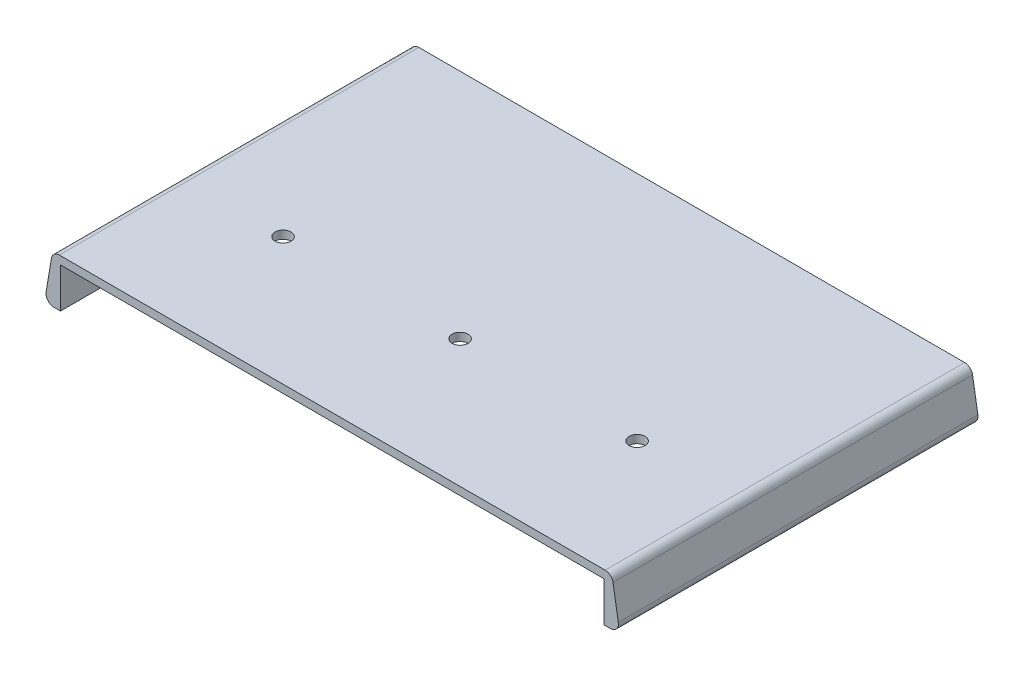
ISO-10303-21;
HEADER;
FILE_DESCRIPTION(('STEP AP214'),'2;1');
FILE_NAME('part.step','',(''),(''),'','','');
FILE_SCHEMA(('AUTOMOTIVE_DESIGN { 1 0 10303 214 1 1 1 1 }'));
ENDSEC;
DATA;
#1=APPLICATION_CONTEXT('core data for automotive mechanical design processes');
#2=APPLICATION_PROTOCOL_DEFINITION('international standard','automotive_design',2000,#1);
#3=PRODUCT_CONTEXT('',#1,'mechanical');
#4=PRODUCT('Part','Part','',(#3));
#5=PRODUCT_RELATED_PRODUCT_CATEGORY('part','',(#4));
#6=PRODUCT_DEFINITION_FORMATION('','',#4);
#7=PRODUCT_DEFINITION_CONTEXT('part definition',#1,'design');
#8=PRODUCT_DEFINITION('design','',#6,#7);
#9=PRODUCT_DEFINITION_SHAPE('','',#8);
#10=(LENGTH_UNIT() NAMED_UNIT(*) SI_UNIT(.MILLI.,.METRE.));
#11=(NAMED_UNIT(*) PLANE_ANGLE_UNIT() SI_UNIT($,.RADIAN.));
#12=(NAMED_UNIT(*) SI_UNIT($,.STERADIAN.) SOLID_ANGLE_UNIT());
#13=UNCERTAINTY_MEASURE_WITH_UNIT(LENGTH_MEASURE(1.E-05),#10,'distance_accuracy_value','');
#14=(GEOMETRIC_REPRESENTATION_CONTEXT(3) GLOBAL_UNCERTAINTY_ASSIGNED_CONTEXT((#13)) GLOBAL_UNIT_ASSIGNED_CONTEXT((#10,
#11,#12)) REPRESENTATION_CONTEXT('',''));
#15=CARTESIAN_POINT('',(0.,0.,0.));
#16=DIRECTION('',(0.,0.,1.));
#17=DIRECTION('',(1.,0.,0.));
#18=AXIS2_PLACEMENT_3D('',#15,#16,#17);
#19=CARTESIAN_POINT('',(-215.9,0.,285.75));
#20=DIRECTION('',(-1.,0.,0.));
#21=DIRECTION('',(0.,0.,1.));
#22=AXIS2_PLACEMENT_3D('',#19,#20,#21);
#23=PLANE('',#22);
#24=DIRECTION('',(0.,1.,0.));
#25=VECTOR('',#24,1.);
#26=CARTESIAN_POINT('',(-215.9,0.,0.));
#27=LINE('',#26,#25);
#28=CARTESIAN_POINT('',(-215.9,-31.75,0.));
#29=VERTEX_POINT('',#28);
#30=CARTESIAN_POINT('',(-215.9,0.,0.));
#31=VERTEX_POINT('',#30);
#32=EDGE_CURVE('E159',#29,#31,#27,.T.);
#33=ORIENTED_EDGE('',*,*,#32,.T.);
#34=DIRECTION('',(0.,0.,-1.));
#35=VECTOR('',#34,1.);
#36=CARTESIAN_POINT('',(-215.9,0.,285.75));
#37=LINE('',#36,#35);
#38=CARTESIAN_POINT('',(-215.9,0.,285.75));
#39=VERTEX_POINT('',#38);
#40=EDGE_CURVE('E12',#39,#31,#37,.T.);
#41=ORIENTED_EDGE('',*,*,#40,.F.);
#42=DIRECTION('',(0.,1.,0.));
#43=VECTOR('',#42,1.);
#44=CARTESIAN_POINT('',(-215.9,0.,285.75));
#45=LINE('',#44,#43);
#46=CARTESIAN_POINT('',(-215.9,-31.75,285.75));
#47=VERTEX_POINT('',#46);
#48=EDGE_CURVE('E182',#47,#39,#45,.T.);
#49=ORIENTED_EDGE('',*,*,#48,.F.);
#50=DIRECTION('',(0.,0.,-1.));
#51=VECTOR('',#50,1.);
#52=CARTESIAN_POINT('',(-215.9,-31.75,285.75));
#53=LINE('',#52,#51);
#54=EDGE_CURVE('E155',#47,#29,#53,.T.);
#55=ORIENTED_EDGE('',*,*,#54,.T.);
#56=EDGE_LOOP('',(#33,#41,#49,#55));
#57=FACE_BOUND('',#56,.T.);
#58=ADVANCED_FACE('F39',(#57),#23,.F.);
#59=CARTESIAN_POINT('',(-215.9,0.,285.75));
#60=DIRECTION('',(0.,1.,0.));
#61=DIRECTION('',(0.,0.,1.));
#62=AXIS2_PLACEMENT_3D('',#59,#60,#61);
#63=PLANE('',#62);
#64=CARTESIAN_POINT('',(140.670742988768,0.,184.15));
#65=DIRECTION('',(0.,1.,0.));
#66=DIRECTION('',(0.,0.,1.));
#67=AXIS2_PLACEMENT_3D('',#64,#65,#66);
#68=CIRCLE('',#67,6.34999999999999);
#69=CARTESIAN_POINT('',(140.670742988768,0.,190.5));
#70=VERTEX_POINT('',#69);
#71=EDGE_CURVE('E371',#70,#70,#68,.T.);
#72=ORIENTED_EDGE('',*,*,#71,.T.);
#73=EDGE_LOOP('',(#72));
#74=FACE_BOUND('',#73,.T.);
#75=CARTESIAN_POINT('',(0.,0.,184.15));
#76=DIRECTION('',(0.,1.,0.));
#77=DIRECTION('',(0.,0.,1.));
#78=AXIS2_PLACEMENT_3D('',#75,#76,#77);
#79=CIRCLE('',#78,6.34999999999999);
#80=CARTESIAN_POINT('',(0.,0.,190.5));
#81=VERTEX_POINT('',#80);
#82=EDGE_CURVE('E375',#81,#81,#79,.T.);
#83=ORIENTED_EDGE('',*,*,#82,.T.);
#84=EDGE_LOOP('',(#83));
#85=FACE_BOUND('',#84,.T.);
#86=CARTESIAN_POINT('',(-140.670742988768,0.,184.15));
#87=DIRECTION('',(0.,1.,0.));
#88=DIRECTION('',(0.,0.,1.));
#89=AXIS2_PLACEMENT_3D('',#86,#87,#88);
#90=CIRCLE('',#89,6.34999999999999);
#91=CARTESIAN_POINT('',(-140.670742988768,0.,190.5));
#92=VERTEX_POINT('',#91);
#93=EDGE_CURVE('E163',#92,#92,#90,.T.);
#94=ORIENTED_EDGE('',*,*,#93,.T.);
#95=EDGE_LOOP('',(#94));
#96=FACE_BOUND('',#95,.T.);
#97=DIRECTION('',(1.,0.,0.));
#98=VECTOR('',#97,1.);
#99=CARTESIAN_POINT('',(-215.9,0.,0.));
#100=LINE('',#99,#98);
#101=CARTESIAN_POINT('',(215.9,0.,0.));
#102=VERTEX_POINT('',#101);
#103=EDGE_CURVE('E162',#31,#102,#100,.T.);
#104=ORIENTED_EDGE('',*,*,#103,.T.);
#105=DIRECTION('',(0.,0.,-1.));
#106=VECTOR('',#105,1.);
#107=CARTESIAN_POINT('',(215.9,0.,285.75));
#108=LINE('',#107,#106);
#109=CARTESIAN_POINT('',(215.9,0.,285.75));
#110=VERTEX_POINT('',#109);
#111=EDGE_CURVE('E47',#110,#102,#108,.T.);
#112=ORIENTED_EDGE('',*,*,#111,.F.);
#113=DIRECTION('',(1.,0.,0.));
#114=VECTOR('',#113,1.);
#115=CARTESIAN_POINT('',(-215.9,0.,285.75));
#116=LINE('',#115,#114);
#117=EDGE_CURVE('E110',#39,#110,#116,.T.);
#118=ORIENTED_EDGE('',*,*,#117,.F.);
#119=ORIENTED_EDGE('',*,*,#40,.T.);
#120=EDGE_LOOP('',(#104,#112,#118,#119));
#121=FACE_BOUND('',#120,.T.);
#122=ADVANCED_FACE('F260',(#74,#85,#96,#121),#63,.F.);
#123=CARTESIAN_POINT('',(215.9,0.,285.75));
#124=DIRECTION('',(1.,0.,0.));
#125=DIRECTION('',(0.,0.,-1.));
#126=AXIS2_PLACEMENT_3D('',#123,#124,#125);
#127=PLANE('',#126);
#128=DIRECTION('',(0.,-1.,0.));
#129=VECTOR('',#128,1.);
#130=CARTESIAN_POINT('',(215.9,0.,0.));
#131=LINE('',#130,#129);
#132=CARTESIAN_POINT('',(215.9,-31.75,0.));
#133=VERTEX_POINT('',#132);
#134=EDGE_CURVE('E165',#102,#133,#131,.T.);
#135=ORIENTED_EDGE('',*,*,#134,.T.);
#136=DIRECTION('',(0.,0.,-1.));
#137=VECTOR('',#136,1.);
#138=CARTESIAN_POINT('',(215.9,-31.75,285.75));
#139=LINE('',#138,#137);
#140=CARTESIAN_POINT('',(215.9,-31.75,285.75));
#141=VERTEX_POINT('',#140);
#142=EDGE_CURVE('E201',#141,#133,#139,.T.);
#143=ORIENTED_EDGE('',*,*,#142,.F.);
#144=DIRECTION('',(0.,-1.,0.));
#145=VECTOR('',#144,1.);
#146=CARTESIAN_POINT('',(215.9,0.,285.75));
#147=LINE('',#146,#145);
#148=EDGE_CURVE('E209',#110,#141,#147,.T.);
#149=ORIENTED_EDGE('',*,*,#148,.F.);
#150=ORIENTED_EDGE('',*,*,#111,.T.);
#151=EDGE_LOOP('',(#135,#143,#149,#150));
#152=FACE_BOUND('',#151,.T.);
#153=ADVANCED_FACE('F207',(#152),#127,.F.);
#154=CARTESIAN_POINT('',(215.9,-31.75,285.75));
#155=DIRECTION('',(0.,1.,0.));
#156=DIRECTION('',(-1.,0.,0.));
#157=AXIS2_PLACEMENT_3D('',#154,#155,#156);
#158=PLANE('',#157);
#159=DIRECTION('',(1.,0.,0.));
#160=VECTOR('',#159,1.);
#161=CARTESIAN_POINT('',(215.9,-31.75,0.));
#162=LINE('',#161,#160);
#163=CARTESIAN_POINT('',(221.104076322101,-31.75,0.));
#164=VERTEX_POINT('',#163);
#165=EDGE_CURVE('E167',#133,#164,#162,.T.);
#166=ORIENTED_EDGE('',*,*,#165,.T.);
#167=DIRECTION('',(0.,0.,-1.));
#168=VECTOR('',#167,1.);
#169=CARTESIAN_POINT('',(221.104076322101,-31.75,285.75));
#170=LINE('',#169,#168);
#171=CARTESIAN_POINT('',(221.104076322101,-31.75,285.75));
#172=VERTEX_POINT('',#171);
#173=EDGE_CURVE('E198',#172,#164,#170,.T.);
#174=ORIENTED_EDGE('',*,*,#173,.F.);
#175=DIRECTION('',(1.,0.,0.));
#176=VECTOR('',#175,1.);
#177=CARTESIAN_POINT('',(215.9,-31.75,285.75));
#178=LINE('',#177,#176);
#179=EDGE_CURVE('E227',#141,#172,#178,.T.);
#180=ORIENTED_EDGE('',*,*,#179,.F.);
#181=ORIENTED_EDGE('',*,*,#142,.T.);
#182=EDGE_LOOP('',(#166,#174,#180,#181));
#183=FACE_BOUND('',#182,.T.);
#184=ADVANCED_FACE('F218',(#183),#158,.F.);
#185=CARTESIAN_POINT('',(221.104076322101,-25.4,285.75));
#186=DIRECTION('',(0.,0.,-1.));
#187=DIRECTION('',(-1.,0.,0.));
#188=AXIS2_PLACEMENT_3D('',#185,#186,#187);
#189=CYLINDRICAL_SURFACE('',#188,6.34999999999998);
#190=CARTESIAN_POINT('',(221.104076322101,-25.4,0.));
#191=DIRECTION('',(0.,0.,1.));
#192=DIRECTION('',(1.,0.,0.));
#193=AXIS2_PLACEMENT_3D('',#190,#191,#192);
#194=CIRCLE('',#193,6.34999999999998);
#195=CARTESIAN_POINT('',(227.367677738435,-24.356066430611,0.));
#196=VERTEX_POINT('',#195);
#197=EDGE_CURVE('E169',#164,#196,#194,.T.);
#198=ORIENTED_EDGE('',*,*,#197,.T.);
#199=DIRECTION('',(0.,0.,-1.));
#200=VECTOR('',#199,1.);
#201=CARTESIAN_POINT('',(227.367677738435,-24.356066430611,285.75));
#202=LINE('',#201,#200);
#203=CARTESIAN_POINT('',(227.367677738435,-24.356066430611,285.75));
#204=VERTEX_POINT('',#203);
#205=EDGE_CURVE('E195',#204,#196,#202,.T.);
#206=ORIENTED_EDGE('',*,*,#205,.F.);
#207=CARTESIAN_POINT('',(221.104076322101,-25.4,285.75));
#208=DIRECTION('',(0.,0.,1.));
#209=DIRECTION('',(1.,0.,0.));
#210=AXIS2_PLACEMENT_3D('',#207,#208,#209);
#211=CIRCLE('',#210,6.34999999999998);
#212=EDGE_CURVE('E224',#172,#204,#211,.T.);
#213=ORIENTED_EDGE('',*,*,#212,.F.);
#214=ORIENTED_EDGE('',*,*,#173,.T.);
#215=EDGE_LOOP('',(#198,#206,#213,#214));
#216=FACE_BOUND('',#215,.T.);
#217=ADVANCED_FACE('F222',(#216),#189,.T.);
#218=CARTESIAN_POINT('',(227.367677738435,-24.356066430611,285.75));
#219=DIRECTION('',(-0.986393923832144,-0.164398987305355,0.));
#220=DIRECTION('',(0.164398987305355,-0.986393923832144,0.));
#221=AXIS2_PLACEMENT_3D('',#218,#219,#220);
#222=PLANE('',#221);
#223=DIRECTION('',(-0.164398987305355,0.986393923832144,0.));
#224=VECTOR('',#223,1.);
#225=CARTESIAN_POINT('',(227.367677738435,-24.356066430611,0.));
#226=LINE('',#225,#224);
#227=CARTESIAN_POINT('',(223.134344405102,1.04393356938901,0.));
#228=VERTEX_POINT('',#227);
#229=EDGE_CURVE('E171',#196,#228,#226,.T.);
#230=ORIENTED_EDGE('',*,*,#229,.T.);
#231=DIRECTION('',(0.,0.,-1.));
#232=VECTOR('',#231,1.);
#233=CARTESIAN_POINT('',(223.134344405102,1.04393356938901,285.75));
#234=LINE('',#233,#232);
#235=CARTESIAN_POINT('',(223.134344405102,1.04393356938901,285.75));
#236=VERTEX_POINT('',#235);
#237=EDGE_CURVE('E192',#236,#228,#234,.T.);
#238=ORIENTED_EDGE('',*,*,#237,.F.);
#239=DIRECTION('',(-0.164398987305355,0.986393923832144,0.));
#240=VECTOR('',#239,1.);
#241=CARTESIAN_POINT('',(227.367677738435,-24.356066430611,285.75));
#242=LINE('',#241,#240);
#243=EDGE_CURVE('E226',#204,#236,#242,.T.);
#244=ORIENTED_EDGE('',*,*,#243,.F.);
#245=ORIENTED_EDGE('',*,*,#205,.T.);
#246=EDGE_LOOP('',(#230,#238,#244,#245));
#247=FACE_BOUND('',#246,.T.);
#248=ADVANCED_FACE('F276',(#247),#222,.F.);
#249=CARTESIAN_POINT('',(216.870742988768,0.,285.75));
#250=DIRECTION('',(0.,0.,-1.));
#251=DIRECTION('',(-1.,0.,0.));
#252=AXIS2_PLACEMENT_3D('',#249,#250,#251);
#253=CYLINDRICAL_SURFACE('',#252,6.34999999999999);
#254=CARTESIAN_POINT('',(216.870742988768,0.,0.));
#255=DIRECTION('',(0.,0.,1.));
#256=DIRECTION('',(1.,0.,0.));
#257=AXIS2_PLACEMENT_3D('',#254,#255,#256);
#258=CIRCLE('',#257,6.34999999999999);
#259=CARTESIAN_POINT('',(216.870742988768,6.34999999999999,0.));
#260=VERTEX_POINT('',#259);
#261=EDGE_CURVE('E173',#228,#260,#258,.T.);
#262=ORIENTED_EDGE('',*,*,#261,.T.);
#263=DIRECTION('',(0.,0.,-1.));
#264=VECTOR('',#263,1.);
#265=CARTESIAN_POINT('',(216.870742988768,6.34999999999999,285.75));
#266=LINE('',#265,#264);
#267=CARTESIAN_POINT('',(216.870742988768,6.34999999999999,285.75));
#268=VERTEX_POINT('',#267);
#269=EDGE_CURVE('E189',#268,#260,#266,.T.);
#270=ORIENTED_EDGE('',*,*,#269,.F.);
#271=CARTESIAN_POINT('',(216.870742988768,0.,285.75));
#272=DIRECTION('',(0.,0.,1.));
#273=DIRECTION('',(1.,0.,0.));
#274=AXIS2_PLACEMENT_3D('',#271,#272,#273);
#275=CIRCLE('',#274,6.34999999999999);
#276=EDGE_CURVE('E229',#236,#268,#275,.T.);
#277=ORIENTED_EDGE('',*,*,#276,.F.);
#278=ORIENTED_EDGE('',*,*,#237,.T.);
#279=EDGE_LOOP('',(#262,#270,#277,#278));
#280=FACE_BOUND('',#279,.T.);
#281=ADVANCED_FACE('F279',(#280),#253,.T.);
#282=CARTESIAN_POINT('',(216.870742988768,6.34999999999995,285.75));
#283=DIRECTION('',(0.,-1.,0.));
#284=DIRECTION('',(0.,0.,-1.));
#285=AXIS2_PLACEMENT_3D('',#282,#283,#284);
#286=PLANE('',#285);
#287=CARTESIAN_POINT('',(140.670742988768,6.34999999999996,184.15));
#288=DIRECTION('',(0.,1.,0.));
#289=DIRECTION('',(0.,0.,1.));
#290=AXIS2_PLACEMENT_3D('',#287,#288,#289);
#291=CIRCLE('',#290,6.34999999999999);
#292=CARTESIAN_POINT('',(140.670742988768,6.34999999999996,190.5));
#293=VERTEX_POINT('',#292);
#294=EDGE_CURVE('E369',#293,#293,#291,.T.);
#295=ORIENTED_EDGE('',*,*,#294,.F.);
#296=EDGE_LOOP('',(#295));
#297=FACE_BOUND('',#296,.T.);
#298=CARTESIAN_POINT('',(0.,6.34999999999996,184.15));
#299=DIRECTION('',(0.,1.,0.));
#300=DIRECTION('',(0.,0.,1.));
#301=AXIS2_PLACEMENT_3D('',#298,#299,#300);
#302=CIRCLE('',#301,6.34999999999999);
#303=CARTESIAN_POINT('',(0.,6.34999999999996,190.5));
#304=VERTEX_POINT('',#303);
#305=EDGE_CURVE('E372',#304,#304,#302,.T.);
#306=ORIENTED_EDGE('',*,*,#305,.F.);
#307=EDGE_LOOP('',(#306));
#308=FACE_BOUND('',#307,.T.);
#309=CARTESIAN_POINT('',(-140.670742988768,6.34999999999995,184.15));
#310=DIRECTION('',(0.,1.,0.));
#311=DIRECTION('',(0.,0.,1.));
#312=AXIS2_PLACEMENT_3D('',#309,#310,#311);
#313=CIRCLE('',#312,6.34999999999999);
#314=CARTESIAN_POINT('',(-140.670742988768,6.34999999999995,190.5));
#315=VERTEX_POINT('',#314);
#316=EDGE_CURVE('E381',#315,#315,#313,.T.);
#317=ORIENTED_EDGE('',*,*,#316,.F.);
#318=EDGE_LOOP('',(#317));
#319=FACE_BOUND('',#318,.T.);
#320=DIRECTION('',(-1.,0.,0.));
#321=VECTOR('',#320,1.);
#322=CARTESIAN_POINT('',(216.870742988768,6.34999999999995,0.));
#323=LINE('',#322,#321);
#324=CARTESIAN_POINT('',(-216.870742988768,6.34999999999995,0.));
#325=VERTEX_POINT('',#324);
#326=EDGE_CURVE('E175',#260,#325,#323,.T.);
#327=ORIENTED_EDGE('',*,*,#326,.T.);
#328=DIRECTION('',(0.,0.,-1.));
#329=VECTOR('',#328,1.);
#330=CARTESIAN_POINT('',(-216.870742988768,6.34999999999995,285.75));
#331=LINE('',#330,#329);
#332=CARTESIAN_POINT('',(-216.870742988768,6.34999999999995,285.75));
#333=VERTEX_POINT('',#332);
#334=EDGE_CURVE('E186',#333,#325,#331,.T.);
#335=ORIENTED_EDGE('',*,*,#334,.F.);
#336=DIRECTION('',(-1.,0.,0.));
#337=VECTOR('',#336,1.);
#338=CARTESIAN_POINT('',(216.870742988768,6.34999999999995,285.75));
#339=LINE('',#338,#337);
#340=EDGE_CURVE('E235',#268,#333,#339,.T.);
#341=ORIENTED_EDGE('',*,*,#340,.F.);
#342=ORIENTED_EDGE('',*,*,#269,.T.);
#343=EDGE_LOOP('',(#327,#335,#341,#342));
#344=FACE_BOUND('',#343,.T.);
#345=ADVANCED_FACE('F241',(#297,#308,#319,#344),#286,.F.);
#346=CARTESIAN_POINT('',(-216.870742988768,0.,285.75));
#347=DIRECTION('',(0.,0.,-1.));
#348=DIRECTION('',(-1.,0.,0.));
#349=AXIS2_PLACEMENT_3D('',#346,#347,#348);
#350=CYLINDRICAL_SURFACE('',#349,6.34999999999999);
#351=CARTESIAN_POINT('',(-216.870742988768,0.,0.));
#352=DIRECTION('',(0.,0.,1.));
#353=DIRECTION('',(-1.,0.,0.));
#354=AXIS2_PLACEMENT_3D('',#351,#352,#353);
#355=CIRCLE('',#354,6.34999999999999);
#356=CARTESIAN_POINT('',(-223.134344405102,1.043933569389,0.));
#357=VERTEX_POINT('',#356);
#358=EDGE_CURVE('E177',#325,#357,#355,.T.);
#359=ORIENTED_EDGE('',*,*,#358,.T.);
#360=DIRECTION('',(0.,0.,-1.));
#361=VECTOR('',#360,1.);
#362=CARTESIAN_POINT('',(-223.134344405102,1.043933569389,285.75));
#363=LINE('',#362,#361);
#364=CARTESIAN_POINT('',(-223.134344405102,1.043933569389,285.75));
#365=VERTEX_POINT('',#364);
#366=EDGE_CURVE('E150',#365,#357,#363,.T.);
#367=ORIENTED_EDGE('',*,*,#366,.F.);
#368=CARTESIAN_POINT('',(-216.870742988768,0.,285.75));
#369=DIRECTION('',(0.,0.,1.));
#370=DIRECTION('',(-1.,0.,0.));
#371=AXIS2_PLACEMENT_3D('',#368,#369,#370);
#372=CIRCLE('',#371,6.34999999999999);
#373=EDGE_CURVE('E141',#333,#365,#372,.T.);
#374=ORIENTED_EDGE('',*,*,#373,.F.);
#375=ORIENTED_EDGE('',*,*,#334,.T.);
#376=EDGE_LOOP('',(#359,#367,#374,#375));
#377=FACE_BOUND('',#376,.T.);
#378=ADVANCED_FACE('F245',(#377),#350,.T.);
#379=CARTESIAN_POINT('',(-227.367677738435,-24.356066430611,285.75));
#380=DIRECTION('',(0.986393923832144,-0.164398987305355,0.));
#381=DIRECTION('',(0.164398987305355,0.986393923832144,0.));
#382=AXIS2_PLACEMENT_3D('',#379,#380,#381);
#383=PLANE('',#382);
#384=DIRECTION('',(-0.164398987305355,-0.986393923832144,0.));
#385=VECTOR('',#384,1.);
#386=CARTESIAN_POINT('',(-227.367677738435,-24.356066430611,0.));
#387=LINE('',#386,#385);
#388=CARTESIAN_POINT('',(-227.367677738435,-24.356066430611,0.));
#389=VERTEX_POINT('',#388);
#390=EDGE_CURVE('E149',#357,#389,#387,.T.);
#391=ORIENTED_EDGE('',*,*,#390,.T.);
#392=DIRECTION('',(0.,0.,-1.));
#393=VECTOR('',#392,1.);
#394=CARTESIAN_POINT('',(-227.367677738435,-24.356066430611,285.75));
#395=LINE('',#394,#393);
#396=CARTESIAN_POINT('',(-227.367677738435,-24.356066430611,285.75));
#397=VERTEX_POINT('',#396);
#398=EDGE_CURVE('E146',#397,#389,#395,.T.);
#399=ORIENTED_EDGE('',*,*,#398,.F.);
#400=DIRECTION('',(-0.164398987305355,-0.986393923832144,0.));
#401=VECTOR('',#400,1.);
#402=CARTESIAN_POINT('',(-227.367677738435,-24.356066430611,285.75));
#403=LINE('',#402,#401);
#404=EDGE_CURVE('E135',#365,#397,#403,.T.);
#405=ORIENTED_EDGE('',*,*,#404,.F.);
#406=ORIENTED_EDGE('',*,*,#366,.T.);
#407=EDGE_LOOP('',(#391,#399,#405,#406));
#408=FACE_BOUND('',#407,.T.);
#409=ADVANCED_FACE('F147',(#408),#383,.F.);
#410=CARTESIAN_POINT('',(-221.104076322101,-25.4,285.75));
#411=DIRECTION('',(0.,0.,-1.));
#412=DIRECTION('',(-1.,0.,0.));
#413=AXIS2_PLACEMENT_3D('',#410,#411,#412);
#414=CYLINDRICAL_SURFACE('',#413,6.34999999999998);
#415=CARTESIAN_POINT('',(-221.104076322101,-25.4,0.));
#416=DIRECTION('',(0.,0.,1.));
#417=DIRECTION('',(-1.,0.,0.));
#418=AXIS2_PLACEMENT_3D('',#415,#416,#417);
#419=CIRCLE('',#418,6.34999999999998);
#420=CARTESIAN_POINT('',(-221.104076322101,-31.75,0.));
#421=VERTEX_POINT('',#420);
#422=EDGE_CURVE('E96',#389,#421,#419,.T.);
#423=ORIENTED_EDGE('',*,*,#422,.T.);
#424=DIRECTION('',(0.,0.,-1.));
#425=VECTOR('',#424,1.);
#426=CARTESIAN_POINT('',(-221.104076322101,-31.75,285.75));
#427=LINE('',#426,#425);
#428=CARTESIAN_POINT('',(-221.104076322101,-31.75,285.75));
#429=VERTEX_POINT('',#428);
#430=EDGE_CURVE('E151',#429,#421,#427,.T.);
#431=ORIENTED_EDGE('',*,*,#430,.F.);
#432=CARTESIAN_POINT('',(-221.104076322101,-25.4,285.75));
#433=DIRECTION('',(0.,0.,1.));
#434=DIRECTION('',(-1.,0.,0.));
#435=AXIS2_PLACEMENT_3D('',#432,#433,#434);
#436=CIRCLE('',#435,6.34999999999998);
#437=EDGE_CURVE('E139',#397,#429,#436,.T.);
#438=ORIENTED_EDGE('',*,*,#437,.F.);
#439=ORIENTED_EDGE('',*,*,#398,.T.);
#440=EDGE_LOOP('',(#423,#431,#438,#439));
#441=FACE_BOUND('',#440,.T.);
#442=ADVANCED_FACE('F153',(#441),#414,.T.);
#443=CARTESIAN_POINT('',(-215.9,-31.75,285.75));
#444=DIRECTION('',(0.,1.,0.));
#445=DIRECTION('',(-1.,0.,0.));
#446=AXIS2_PLACEMENT_3D('',#443,#444,#445);
#447=PLANE('',#446);
#448=DIRECTION('',(1.,0.,0.));
#449=VECTOR('',#448,1.);
#450=CARTESIAN_POINT('',(-215.9,-31.75,0.));
#451=LINE('',#450,#449);
#452=EDGE_CURVE('E102',#421,#29,#451,.T.);
#453=ORIENTED_EDGE('',*,*,#452,.T.);
#454=ORIENTED_EDGE('',*,*,#54,.F.);
#455=DIRECTION('',(1.,0.,0.));
#456=VECTOR('',#455,1.);
#457=CARTESIAN_POINT('',(-215.9,-31.75,285.75));
#458=LINE('',#457,#456);
#459=EDGE_CURVE('E55',#429,#47,#458,.T.);
#460=ORIENTED_EDGE('',*,*,#459,.F.);
#461=ORIENTED_EDGE('',*,*,#430,.T.);
#462=EDGE_LOOP('',(#453,#454,#460,#461));
#463=FACE_BOUND('',#462,.T.);
#464=ADVANCED_FACE('F249',(#463),#447,.F.);
#465=CARTESIAN_POINT('',(-221.104076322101,-25.4,285.75));
#466=DIRECTION('',(0.,0.,-1.));
#467=DIRECTION('',(-1.,0.,0.));
#468=AXIS2_PLACEMENT_3D('',#465,#466,#467);
#469=PLANE('',#468);
#470=ORIENTED_EDGE('',*,*,#48,.T.);
#471=ORIENTED_EDGE('',*,*,#117,.T.);
#472=ORIENTED_EDGE('',*,*,#148,.T.);
#473=ORIENTED_EDGE('',*,*,#179,.T.);
#474=ORIENTED_EDGE('',*,*,#212,.T.);
#475=ORIENTED_EDGE('',*,*,#243,.T.);
#476=ORIENTED_EDGE('',*,*,#276,.T.);
#477=ORIENTED_EDGE('',*,*,#340,.T.);
#478=ORIENTED_EDGE('',*,*,#373,.T.);
#479=ORIENTED_EDGE('',*,*,#404,.T.);
#480=ORIENTED_EDGE('',*,*,#437,.T.);
#481=ORIENTED_EDGE('',*,*,#459,.T.);
#482=EDGE_LOOP('',(#470,#471,#472,#473,#474,#475,#476,#477,#478,#479,#480,#481));
#483=FACE_BOUND('',#482,.T.);
#484=ADVANCED_FACE('F137',(#483),#469,.F.);
#485=CARTESIAN_POINT('',(-221.104076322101,-25.4,0.));
#486=DIRECTION('',(0.,0.,-1.));
#487=DIRECTION('',(-1.,0.,0.));
#488=AXIS2_PLACEMENT_3D('',#485,#486,#487);
#489=PLANE('',#488);
#490=ORIENTED_EDGE('',*,*,#32,.F.);
#491=ORIENTED_EDGE('',*,*,#452,.F.);
#492=ORIENTED_EDGE('',*,*,#422,.F.);
#493=ORIENTED_EDGE('',*,*,#390,.F.);
#494=ORIENTED_EDGE('',*,*,#358,.F.);
#495=ORIENTED_EDGE('',*,*,#326,.F.);
#496=ORIENTED_EDGE('',*,*,#261,.F.);
#497=ORIENTED_EDGE('',*,*,#229,.F.);
#498=ORIENTED_EDGE('',*,*,#197,.F.);
#499=ORIENTED_EDGE('',*,*,#165,.F.);
#500=ORIENTED_EDGE('',*,*,#134,.F.);
#501=ORIENTED_EDGE('',*,*,#103,.F.);
#502=EDGE_LOOP('',(#490,#491,#492,#493,#494,#495,#496,#497,#498,#499,#500,#501));
#503=FACE_BOUND('',#502,.T.);
#504=ADVANCED_FACE('F213',(#503),#489,.T.);
#505=CARTESIAN_POINT('',(-140.670742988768,-31.75,184.15));
#506=DIRECTION('',(0.,1.,0.));
#507=DIRECTION('',(0.,0.,1.));
#508=AXIS2_PLACEMENT_3D('',#505,#506,#507);
#509=CYLINDRICAL_SURFACE('',#508,6.34999999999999);
#510=ORIENTED_EDGE('',*,*,#316,.T.);
#511=EDGE_LOOP('',(#510));
#512=FACE_BOUND('',#511,.T.);
#513=ORIENTED_EDGE('',*,*,#93,.F.);
#514=EDGE_LOOP('',(#513));
#515=FACE_BOUND('',#514,.T.);
#516=ADVANCED_FACE('F317',(#512,#515),#509,.F.);
#517=CARTESIAN_POINT('',(0.,-31.75,184.15));
#518=DIRECTION('',(0.,1.,0.));
#519=DIRECTION('',(0.,0.,1.));
#520=AXIS2_PLACEMENT_3D('',#517,#518,#519);
#521=CYLINDRICAL_SURFACE('',#520,6.34999999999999);
#522=ORIENTED_EDGE('',*,*,#305,.T.);
#523=EDGE_LOOP('',(#522));
#524=FACE_BOUND('',#523,.T.);
#525=ORIENTED_EDGE('',*,*,#82,.F.);
#526=EDGE_LOOP('',(#525));
#527=FACE_BOUND('',#526,.T.);
#528=ADVANCED_FACE('F324',(#524,#527),#521,.F.);
#529=CARTESIAN_POINT('',(140.670742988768,-31.75,184.15));
#530=DIRECTION('',(0.,1.,0.));
#531=DIRECTION('',(0.,0.,1.));
#532=AXIS2_PLACEMENT_3D('',#529,#530,#531);
#533=CYLINDRICAL_SURFACE('',#532,6.34999999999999);
#534=ORIENTED_EDGE('',*,*,#294,.T.);
#535=EDGE_LOOP('',(#534));
#536=FACE_BOUND('',#535,.T.);
#537=ORIENTED_EDGE('',*,*,#71,.F.);
#538=EDGE_LOOP('',(#537));
#539=FACE_BOUND('',#538,.T.);
#540=ADVANCED_FACE('F351',(#536,#539),#533,.F.);
#541=CLOSED_SHELL('',(#58,#122,#153,#184,#217,#248,#281,#345,#378,#409,#442,#464,#484,#504,#516,
#528,#540));
#542=MANIFOLD_SOLID_BREP('B2',#541);
#543=ADVANCED_BREP_SHAPE_REPRESENTATION('',(#18,#542),#14);
#544=SHAPE_DEFINITION_REPRESENTATION(#9,#543);
ENDSEC;
END-ISO-10303-21;
